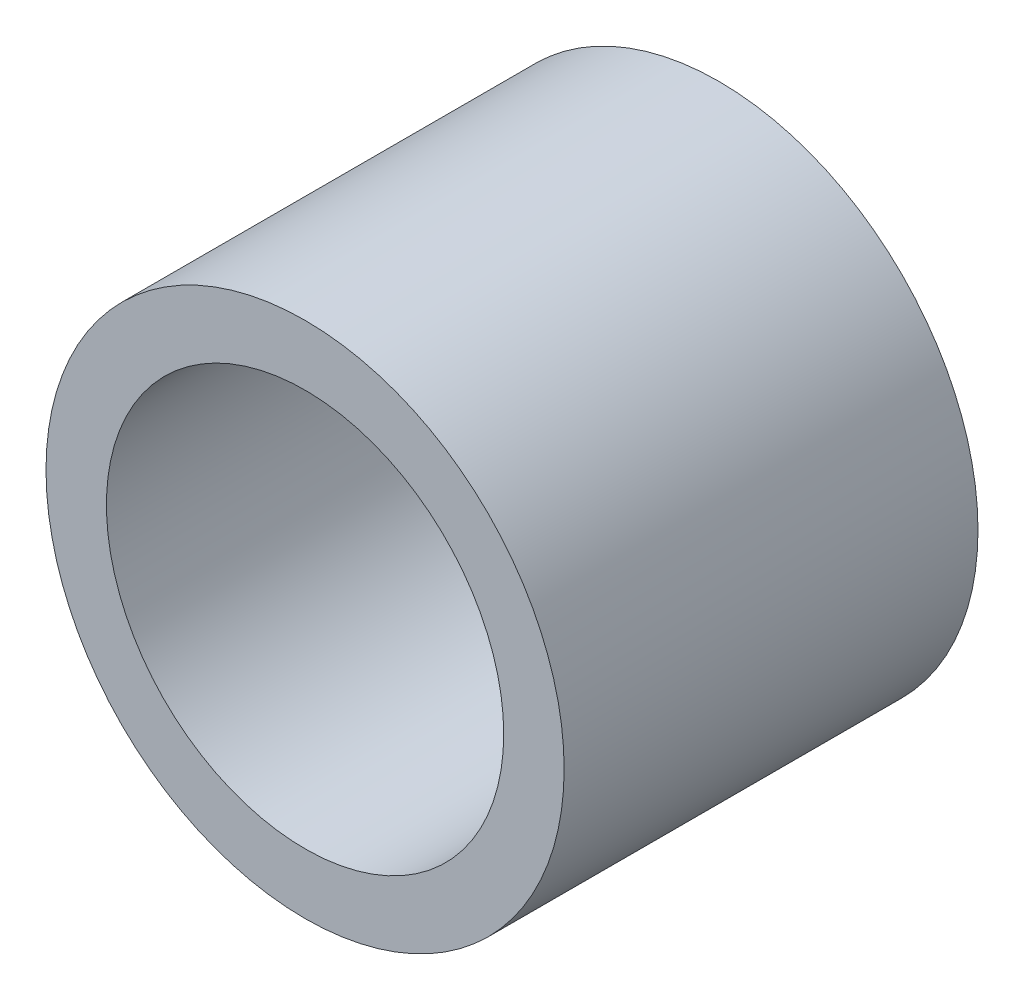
ISO-10303-21;
HEADER;
FILE_DESCRIPTION(('STEP AP214'),'2;1');
FILE_NAME('part.step','',(''),(''),'','','');
FILE_SCHEMA(('AUTOMOTIVE_DESIGN { 1 0 10303 214 1 1 1 1 }'));
ENDSEC;
DATA;
#1=APPLICATION_CONTEXT('core data for automotive mechanical design processes');
#2=APPLICATION_PROTOCOL_DEFINITION('international standard','automotive_design',2000,#1);
#3=PRODUCT_CONTEXT('',#1,'mechanical');
#4=PRODUCT('Part','Part','',(#3));
#5=PRODUCT_RELATED_PRODUCT_CATEGORY('part','',(#4));
#6=PRODUCT_DEFINITION_FORMATION('','',#4);
#7=PRODUCT_DEFINITION_CONTEXT('part definition',#1,'design');
#8=PRODUCT_DEFINITION('design','',#6,#7);
#9=PRODUCT_DEFINITION_SHAPE('','',#8);
#10=(LENGTH_UNIT() NAMED_UNIT(*) SI_UNIT(.MILLI.,.METRE.));
#11=(NAMED_UNIT(*) PLANE_ANGLE_UNIT() SI_UNIT($,.RADIAN.));
#12=(NAMED_UNIT(*) SI_UNIT($,.STERADIAN.) SOLID_ANGLE_UNIT());
#13=UNCERTAINTY_MEASURE_WITH_UNIT(LENGTH_MEASURE(1.E-05),#10,'distance_accuracy_value','');
#14=(GEOMETRIC_REPRESENTATION_CONTEXT(3) GLOBAL_UNCERTAINTY_ASSIGNED_CONTEXT((#13)) GLOBAL_UNIT_ASSIGNED_CONTEXT((#10,
#11,#12)) REPRESENTATION_CONTEXT('',''));
#15=CARTESIAN_POINT('',(0.,0.,0.));
#16=DIRECTION('',(0.,0.,1.));
#17=DIRECTION('',(1.,0.,0.));
#18=AXIS2_PLACEMENT_3D('',#15,#16,#17);
#19=CARTESIAN_POINT('',(0.,0.,3.175));
#20=DIRECTION('',(0.,0.,1.));
#21=DIRECTION('',(1.,0.,0.));
#22=AXIS2_PLACEMENT_3D('',#19,#20,#21);
#23=PLANE('',#22);
#24=CARTESIAN_POINT('',(0.,0.,3.175));
#25=DIRECTION('',(0.,0.,1.));
#26=DIRECTION('',(1.,0.,0.));
#27=AXIS2_PLACEMENT_3D('',#24,#25,#26);
#28=CIRCLE('',#27,3.048);
#29=CARTESIAN_POINT('',(3.048,0.,3.175));
#30=VERTEX_POINT('',#29);
#31=EDGE_CURVE('E44',#30,#30,#28,.T.);
#32=ORIENTED_EDGE('',*,*,#31,.F.);
#33=EDGE_LOOP('',(#32));
#34=FACE_BOUND('',#33,.T.);
#35=CARTESIAN_POINT('',(0.,0.,3.175));
#36=DIRECTION('',(0.,0.,1.));
#37=DIRECTION('',(1.,0.,0.));
#38=AXIS2_PLACEMENT_3D('',#35,#36,#37);
#39=CIRCLE('',#38,3.9751);
#40=CARTESIAN_POINT('',(3.9751,0.,3.175));
#41=VERTEX_POINT('',#40);
#42=EDGE_CURVE('E10',#41,#41,#39,.T.);
#43=ORIENTED_EDGE('',*,*,#42,.T.);
#44=EDGE_LOOP('',(#43));
#45=FACE_BOUND('',#44,.T.);
#46=ADVANCED_FACE('F31',(#34,#45),#23,.T.);
#47=CARTESIAN_POINT('',(0.,0.,-3.175));
#48=DIRECTION('',(0.,0.,1.));
#49=DIRECTION('',(1.,0.,0.));
#50=AXIS2_PLACEMENT_3D('',#47,#48,#49);
#51=PLANE('',#50);
#52=CARTESIAN_POINT('',(0.,0.,-3.175));
#53=DIRECTION('',(0.,0.,1.));
#54=DIRECTION('',(1.,0.,0.));
#55=AXIS2_PLACEMENT_3D('',#52,#53,#54);
#56=CIRCLE('',#55,3.048);
#57=CARTESIAN_POINT('',(3.048,0.,-3.175));
#58=VERTEX_POINT('',#57);
#59=EDGE_CURVE('E42',#58,#58,#56,.T.);
#60=ORIENTED_EDGE('',*,*,#59,.T.);
#61=EDGE_LOOP('',(#60));
#62=FACE_BOUND('',#61,.T.);
#63=CARTESIAN_POINT('',(0.,0.,-3.175));
#64=DIRECTION('',(0.,0.,1.));
#65=DIRECTION('',(1.,0.,0.));
#66=AXIS2_PLACEMENT_3D('',#63,#64,#65);
#67=CIRCLE('',#66,3.9751);
#68=CARTESIAN_POINT('',(3.9751,0.,-3.175));
#69=VERTEX_POINT('',#68);
#70=EDGE_CURVE('E35',#69,#69,#67,.T.);
#71=ORIENTED_EDGE('',*,*,#70,.F.);
#72=EDGE_LOOP('',(#71));
#73=FACE_BOUND('',#72,.T.);
#74=ADVANCED_FACE('F50',(#62,#73),#51,.F.);
#75=CARTESIAN_POINT('',(0.,0.,3.175));
#76=DIRECTION('',(0.,0.,-1.));
#77=DIRECTION('',(-1.,0.,0.));
#78=AXIS2_PLACEMENT_3D('',#75,#76,#77);
#79=CYLINDRICAL_SURFACE('',#78,3.9751);
#80=ORIENTED_EDGE('',*,*,#42,.F.);
#81=EDGE_LOOP('',(#80));
#82=FACE_BOUND('',#81,.T.);
#83=ORIENTED_EDGE('',*,*,#70,.T.);
#84=EDGE_LOOP('',(#83));
#85=FACE_BOUND('',#84,.T.);
#86=ADVANCED_FACE('F33',(#82,#85),#79,.T.);
#87=CARTESIAN_POINT('',(0.,0.,-3.175));
#88=DIRECTION('',(0.,0.,1.));
#89=DIRECTION('',(1.,0.,0.));
#90=AXIS2_PLACEMENT_3D('',#87,#88,#89);
#91=CYLINDRICAL_SURFACE('',#90,3.048);
#92=ORIENTED_EDGE('',*,*,#59,.F.);
#93=EDGE_LOOP('',(#92));
#94=FACE_BOUND('',#93,.T.);
#95=ORIENTED_EDGE('',*,*,#31,.T.);
#96=EDGE_LOOP('',(#95));
#97=FACE_BOUND('',#96,.T.);
#98=ADVANCED_FACE('F53',(#94,#97),#91,.F.);
#99=CLOSED_SHELL('',(#46,#74,#86,#98));
#100=MANIFOLD_SOLID_BREP('B2',#99);
#101=ADVANCED_BREP_SHAPE_REPRESENTATION('',(#18,#100),#14);
#102=SHAPE_DEFINITION_REPRESENTATION(#9,#101);
ENDSEC;
END-ISO-10303-21;
